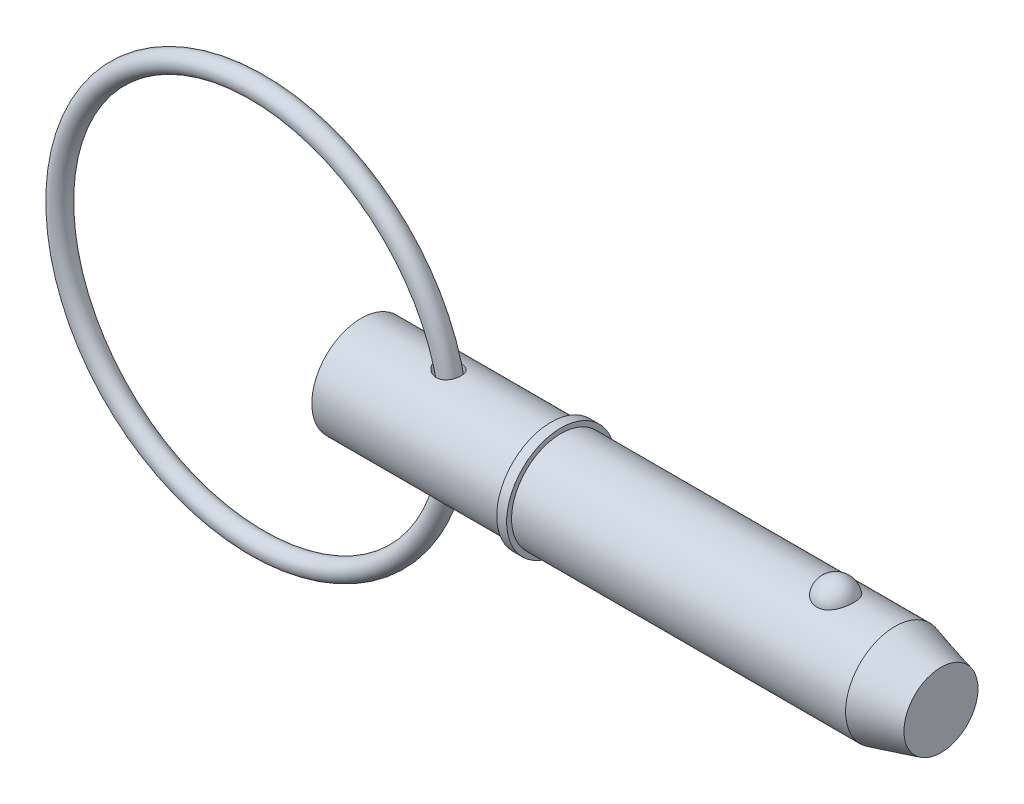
ISO-10303-21;
HEADER;
FILE_DESCRIPTION(('STEP AP214'),'2;1');
FILE_NAME('part.step','',(''),(''),'','','');
FILE_SCHEMA(('AUTOMOTIVE_DESIGN { 1 0 10303 214 1 1 1 1 }'));
ENDSEC;
DATA;
#1=APPLICATION_CONTEXT('core data for automotive mechanical design processes');
#2=APPLICATION_PROTOCOL_DEFINITION('international standard','automotive_design',2000,#1);
#3=PRODUCT_CONTEXT('',#1,'mechanical');
#4=PRODUCT('Part','Part','',(#3));
#5=PRODUCT_RELATED_PRODUCT_CATEGORY('part','',(#4));
#6=PRODUCT_DEFINITION_FORMATION('','',#4);
#7=PRODUCT_DEFINITION_CONTEXT('part definition',#1,'design');
#8=PRODUCT_DEFINITION('design','',#6,#7);
#9=PRODUCT_DEFINITION_SHAPE('','',#8);
#10=(LENGTH_UNIT() NAMED_UNIT(*) SI_UNIT(.MILLI.,.METRE.));
#11=(NAMED_UNIT(*) PLANE_ANGLE_UNIT() SI_UNIT($,.RADIAN.));
#12=(NAMED_UNIT(*) SI_UNIT($,.STERADIAN.) SOLID_ANGLE_UNIT());
#13=UNCERTAINTY_MEASURE_WITH_UNIT(LENGTH_MEASURE(1.E-05),#10,'distance_accuracy_value','');
#14=(GEOMETRIC_REPRESENTATION_CONTEXT(3) GLOBAL_UNCERTAINTY_ASSIGNED_CONTEXT((#13)) GLOBAL_UNIT_ASSIGNED_CONTEXT((#10,
#11,#12)) REPRESENTATION_CONTEXT('',''));
#15=CARTESIAN_POINT('',(0.,0.,0.));
#16=DIRECTION('',(0.,0.,1.));
#17=DIRECTION('',(1.,0.,0.));
#18=AXIS2_PLACEMENT_3D('',#15,#16,#17);
#19=CARTESIAN_POINT('',(-13.3798047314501,0.,0.));
#20=DIRECTION('',(0.,0.,1.));
#21=DIRECTION('',(1.,0.,0.));
#22=AXIS2_PLACEMENT_3D('',#19,#20,#21);
#23=TOROIDAL_SURFACE('',#22,25.4,1.27);
#24=CARTESIAN_POINT('',(13.2901952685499,0.,0.));
#25=VERTEX_POINT('',#24);
#26=VERTEX_LOOP('',#25);
#27=FACE_BOUND('',#26,.T.);
#28=ADVANCED_FACE('P0_F12',(#27),#23,.T.);
#29=CLOSED_SHELL('',(#28));
#30=MANIFOLD_SOLID_BREP('P0_B1',#29);
#31=CARTESIAN_POINT('',(0.,0.,0.));
#32=DIRECTION('',(1.,0.,0.));
#33=DIRECTION('',(0.,0.,-1.));
#34=AXIS2_PLACEMENT_3D('',#31,#32,#33);
#35=CYLINDRICAL_SURFACE('',#34,6.35);
#36=CARTESIAN_POINT('',(9.67500140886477,6.32698634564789,-0.540133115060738));
#37=CARTESIAN_POINT('',(9.70878953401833,6.3197498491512,-0.624879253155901));
#38=CARTESIAN_POINT('',(9.75028044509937,6.31105328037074,-0.706504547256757));
#39=CARTESIAN_POINT('',(9.84659255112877,6.29180070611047,-0.861319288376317));
#40=CARTESIAN_POINT('',(9.90144039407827,6.28124099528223,-0.934491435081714));
#41=CARTESIAN_POINT('',(10.021999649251,6.25949497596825,-1.0704877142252));
#42=CARTESIAN_POINT('',(10.0876589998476,6.2483118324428,-1.1333586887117));
#43=CARTESIAN_POINT('',(10.2280180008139,6.22641783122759,-1.24805262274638));
#44=CARTESIAN_POINT('',(10.3027159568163,6.21570688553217,-1.29987764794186));
#45=CARTESIAN_POINT('',(10.4650889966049,6.19509606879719,-1.39492899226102));
#46=CARTESIAN_POINT('',(10.5533142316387,6.1853135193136,-1.4372443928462));
#47=CARTESIAN_POINT('',(10.7357818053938,6.16871128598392,-1.50691441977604));
#48=CARTESIAN_POINT('',(10.8300253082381,6.16189217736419,-1.53426614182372));
#49=CARTESIAN_POINT('',(11.0227953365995,6.15211299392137,-1.57302798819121));
#50=CARTESIAN_POINT('',(11.1213511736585,6.14918579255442,-1.58430237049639));
#51=CARTESIAN_POINT('',(11.3189518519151,6.1478413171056,-1.58951619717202));
#52=CARTESIAN_POINT('',(11.417996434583,6.14942187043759,-1.58346399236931));
#53=CARTESIAN_POINT('',(11.6070859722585,6.15678569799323,-1.55457003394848));
#54=CARTESIAN_POINT('',(11.6973059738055,6.16229943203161,-1.53280404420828));
#55=CARTESIAN_POINT('',(11.8723373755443,6.176630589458,-1.4739892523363));
#56=CARTESIAN_POINT('',(11.9571502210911,6.185447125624,-1.43694455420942));
#57=CARTESIAN_POINT('',(12.1146737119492,6.20482821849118,-1.3507217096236));
#58=CARTESIAN_POINT('',(12.1877743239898,6.21528554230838,-1.30222952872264));
#59=CARTESIAN_POINT('',(12.324618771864,6.23705116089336,-1.19362916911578));
#60=CARTESIAN_POINT('',(12.3883628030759,6.24835943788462,-1.1335212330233));
#61=CARTESIAN_POINT('',(12.5046662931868,6.27053957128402,-1.00357204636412));
#62=CARTESIAN_POINT('',(12.5572571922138,6.28141258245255,-0.933759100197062));
#63=CARTESIAN_POINT('',(12.6502125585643,6.30157953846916,-0.786214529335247));
#64=CARTESIAN_POINT('',(12.6905764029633,6.31087340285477,-0.708482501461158));
#65=CARTESIAN_POINT('',(12.7585531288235,6.32699259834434,-0.546246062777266));
#66=CARTESIAN_POINT('',(12.7860022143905,6.33378599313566,-0.461669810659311));
#67=CARTESIAN_POINT('',(12.8267605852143,6.34401050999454,-0.288980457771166));
#68=CARTESIAN_POINT('',(12.8400695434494,6.34744155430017,-0.200867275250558));
#69=CARTESIAN_POINT('',(12.8522644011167,6.35058177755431,-0.0231943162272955));
#70=CARTESIAN_POINT('',(12.8510870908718,6.35027464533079,0.0663700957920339));
#71=CARTESIAN_POINT('',(12.8341831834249,6.34593169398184,0.244024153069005));
#72=CARTESIAN_POINT('',(12.8184563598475,6.341895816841,0.332113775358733));
#73=CARTESIAN_POINT('',(12.7728208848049,6.33052992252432,0.504322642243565));
#74=CARTESIAN_POINT('',(12.7429114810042,6.32319973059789,0.588441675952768));
#75=CARTESIAN_POINT('',(12.6696162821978,6.30604116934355,0.750316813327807));
#76=CARTESIAN_POINT('',(12.6262302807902,6.29621276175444,0.828072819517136));
#77=CARTESIAN_POINT('',(12.5270856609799,6.27515240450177,0.974918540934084));
#78=CARTESIAN_POINT('',(12.4713403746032,6.26392197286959,1.04401746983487));
#79=CARTESIAN_POINT('',(12.3488662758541,6.24131002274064,1.1716478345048));
#80=CARTESIAN_POINT('',(12.2821384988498,6.22992851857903,1.23018026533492));
#81=CARTESIAN_POINT('',(12.1401870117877,6.20841765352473,1.33449214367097));
#82=CARTESIAN_POINT('',(12.0650507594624,6.19827734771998,1.38038832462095));
#83=CARTESIAN_POINT('',(11.9079044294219,6.18026478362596,1.45892404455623));
#84=CARTESIAN_POINT('',(11.8258951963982,6.17239224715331,1.49156520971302));
#85=CARTESIAN_POINT('',(11.6581736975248,6.15982613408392,1.54263810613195));
#86=CARTESIAN_POINT('',(11.572502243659,6.15510409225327,1.56119728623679));
#87=CARTESIAN_POINT('',(11.3991899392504,6.14916283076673,1.58443707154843));
#88=CARTESIAN_POINT('',(11.3115488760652,6.14794399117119,1.58911617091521));
#89=CARTESIAN_POINT('',(11.1345547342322,6.14904466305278,1.58485137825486));
#90=CARTESIAN_POINT('',(11.0452104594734,6.15144894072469,1.5755811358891));
#91=CARTESIAN_POINT('',(10.8691479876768,6.15957601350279,1.54349959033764));
#92=CARTESIAN_POINT('',(10.782430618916,6.16529984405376,1.52068406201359));
#93=CARTESIAN_POINT('',(10.6082848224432,6.17983892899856,1.4605156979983));
#94=CARTESIAN_POINT('',(10.5211557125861,6.1888262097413,1.42233764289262));
#95=CARTESIAN_POINT('',(10.3542377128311,6.20874782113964,1.33268652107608));
#96=CARTESIAN_POINT('',(10.2744521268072,6.21968302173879,1.28120750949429));
#97=CARTESIAN_POINT('',(10.120854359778,6.24282707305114,1.16334748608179));
#98=CARTESIAN_POINT('',(10.0474902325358,6.25507146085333,1.09638652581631));
#99=CARTESIAN_POINT('',(9.91368693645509,6.27890019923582,0.950453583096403));
#100=CARTESIAN_POINT('',(9.85324511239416,6.29048468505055,0.87148407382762));
#101=CARTESIAN_POINT('',(9.75037543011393,6.31102161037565,0.707140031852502));
#102=CARTESIAN_POINT('',(9.70726585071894,6.32006820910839,0.622206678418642));
#103=CARTESIAN_POINT('',(9.63775895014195,6.33497125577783,0.445490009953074));
#104=CARTESIAN_POINT('',(9.61134627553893,6.34083063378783,0.35371307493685));
#105=CARTESIAN_POINT('',(9.57891955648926,6.34807071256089,0.177220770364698));
#106=CARTESIAN_POINT('',(9.5709352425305,6.3498832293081,0.0928817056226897));
#107=CARTESIAN_POINT('',(9.56994851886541,6.35010532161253,-0.0758268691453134));
#108=CARTESIAN_POINT('',(9.57692695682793,6.34851924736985,-0.160196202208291));
#109=CARTESIAN_POINT('',(9.59985709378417,6.34339435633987,-0.294043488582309));
#110=CARTESIAN_POINT('',(9.61128951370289,6.34084912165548,-0.34438537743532));
#111=CARTESIAN_POINT('',(9.63933183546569,6.33468615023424,-0.443526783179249));
#112=CARTESIAN_POINT('',(9.65594100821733,6.33106856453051,-0.492326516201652));
#113=CARTESIAN_POINT('',(9.67500140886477,6.32698634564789,-0.540133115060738));
#114=B_SPLINE_CURVE_WITH_KNOTS('',3,(#36,#37,#38,#39,#40,#41,#42,#43,#44,#45,#46,#47,#48,#49,
#50,#51,#52,#53,#54,#55,#56,#57,#58,#59,#60,#61,#62,#63,#64,#65,#66,#67,#68,#69,#70,#71,#72,#73,
#74,#75,#76,#77,#78,#79,#80,#81,#82,#83,#84,#85,#86,#87,#88,#89,#90,#91,#92,#93,#94,#95,#96,#97,
#98,#99,#100,#101,#102,#103,#104,#105,#106,#107,#108,#109,#110,#111,#112,#113),.UNSPECIFIED.,
.T.,.F.,(4,2,2,2,2,2,2,2,2,2,2,2,2,2,2,2,2,2,2,2,2,2,2,2,2,2,2,2,2,2,2,2,2,2,2,2,2,2,4),(0.,
0.274348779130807,0.54924945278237,0.822863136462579,1.09642560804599,1.3900770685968,
1.68378550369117,1.97995934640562,2.27599046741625,2.55347281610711,2.83088067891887,
3.09465189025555,3.35841759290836,3.62142956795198,3.88445494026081,4.1507318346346,
4.4170148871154,4.68446025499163,4.95190978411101,5.21937350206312,5.48684131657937,
5.75402200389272,6.02117751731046,6.28577524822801,6.55034050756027,6.81248178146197,
7.0746514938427,7.34305086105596,7.61153399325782,7.89692981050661,8.18245340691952,
8.48120635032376,8.77989784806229,9.06530254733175,9.35044442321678,9.60331609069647,
9.85586427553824,10.010650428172,10.1654147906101),.UNSPECIFIED.);
#115=CARTESIAN_POINT('',(9.67500140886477,6.32698634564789,-0.540133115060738));
#116=VERTEX_POINT('',#115);
#117=EDGE_CURVE('P1_E42',#116,#116,#114,.T.);
#118=ORIENTED_EDGE('',*,*,#117,.T.);
#119=EDGE_LOOP('',(#118));
#120=FACE_BOUND('',#119,.T.);
#121=CARTESIAN_POINT('',(0.,0.,0.));
#122=DIRECTION('',(1.,0.,0.));
#123=DIRECTION('',(0.,0.,-1.));
#124=AXIS2_PLACEMENT_3D('',#121,#122,#123);
#125=CIRCLE('',#124,6.35);
#126=CARTESIAN_POINT('',(0.,0.,-6.35));
#127=VERTEX_POINT('',#126);
#128=EDGE_CURVE('P1_E9',#127,#127,#125,.T.);
#129=ORIENTED_EDGE('',*,*,#128,.T.);
#130=EDGE_LOOP('',(#129));
#131=FACE_BOUND('',#130,.T.);
#132=CARTESIAN_POINT('',(24.43,0.,0.));
#133=DIRECTION('',(1.,0.,0.));
#134=DIRECTION('',(0.,0.,-1.));
#135=AXIS2_PLACEMENT_3D('',#132,#133,#134);
#136=CIRCLE('',#135,6.35);
#137=CARTESIAN_POINT('',(24.43,0.,-6.35));
#138=VERTEX_POINT('',#137);
#139=EDGE_CURVE('P1_E25',#138,#138,#136,.T.);
#140=ORIENTED_EDGE('',*,*,#139,.F.);
#141=EDGE_LOOP('',(#140));
#142=FACE_BOUND('',#141,.T.);
#143=CARTESIAN_POINT('',(9.67500140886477,-6.32698634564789,-0.540133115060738));
#144=CARTESIAN_POINT('',(9.64544894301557,-6.33331515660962,-0.46600258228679));
#145=CARTESIAN_POINT('',(9.62177180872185,-6.33852974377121,-0.389437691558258));
#146=CARTESIAN_POINT('',(9.58727043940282,-6.34619174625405,-0.233330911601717));
#147=CARTESIAN_POINT('',(9.57644043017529,-6.34864040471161,-0.153790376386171));
#148=CARTESIAN_POINT('',(9.56819517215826,-6.3505010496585,0.00612071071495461));
#149=CARTESIAN_POINT('',(9.57079639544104,-6.34990930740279,0.0864921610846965));
#150=CARTESIAN_POINT('',(9.58930797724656,-6.3457478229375,0.245607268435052));
#151=CARTESIAN_POINT('',(9.60522046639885,-6.34217760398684,0.324350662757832));
#152=CARTESIAN_POINT('',(9.64931570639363,-6.3324977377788,0.47727605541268));
#153=CARTESIAN_POINT('',(9.67737525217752,-6.32641361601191,0.551495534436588));
#154=CARTESIAN_POINT('',(9.74451510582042,-6.31231128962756,0.69455132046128));
#155=CARTESIAN_POINT('',(9.78359827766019,-6.30429258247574,0.763386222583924));
#156=CARTESIAN_POINT('',(9.87474700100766,-6.28638332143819,0.899414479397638));
#157=CARTESIAN_POINT('',(9.92757481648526,-6.27639669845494,0.966083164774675));
#158=CARTESIAN_POINT('',(10.042675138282,-6.25596164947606,1.09061181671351));
#159=CARTESIAN_POINT('',(10.1049521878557,-6.24551300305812,1.14846751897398));
#160=CARTESIAN_POINT('',(10.2445505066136,-6.22397505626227,1.26024641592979));
#161=CARTESIAN_POINT('',(10.3227711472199,-6.2129394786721,1.31305951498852));
#162=CARTESIAN_POINT('',(10.4867924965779,-6.19263757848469,1.40570084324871));
#163=CARTESIAN_POINT('',(10.5725962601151,-6.18337197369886,1.44552380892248));
#164=CARTESIAN_POINT('',(10.7543302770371,-6.16725983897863,1.51283687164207));
#165=CARTESIAN_POINT('',(10.8505554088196,-6.16056505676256,1.53957358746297));
#166=CARTESIAN_POINT('',(11.0463546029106,-6.15127671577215,1.57628137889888));
#167=CARTESIAN_POINT('',(11.1459276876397,-6.14868197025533,1.58625730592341));
#168=CARTESIAN_POINT('',(11.3414257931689,-6.14810798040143,1.58848000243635));
#169=CARTESIAN_POINT('',(11.4373417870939,-6.14995283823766,1.58140242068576));
#170=CARTESIAN_POINT('',(11.6262783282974,-6.1577972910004,1.55057566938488));
#171=CARTESIAN_POINT('',(11.719300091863,-6.16379511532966,1.52683360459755));
#172=CARTESIAN_POINT('',(11.8934223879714,-6.17873566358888,1.46514575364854));
#173=CARTESIAN_POINT('',(11.9749048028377,-6.18746207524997,1.42822144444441));
#174=CARTESIAN_POINT('',(12.1301362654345,-6.20693584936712,1.34105645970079));
#175=CARTESIAN_POINT('',(12.2038861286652,-6.21768299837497,1.29081719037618));
#176=CARTESIAN_POINT('',(12.3399792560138,-6.23970077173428,1.17972764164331));
#177=CARTESIAN_POINT('',(12.4025430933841,-6.25095401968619,1.11914355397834));
#178=CARTESIAN_POINT('',(12.5166805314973,-6.27296916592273,0.988307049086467));
#179=CARTESIAN_POINT('',(12.568253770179,-6.28373104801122,0.918054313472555));
#180=CARTESIAN_POINT('',(12.6596230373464,-6.3037060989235,0.769081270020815));
#181=CARTESIAN_POINT('',(12.6992956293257,-6.31290263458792,0.690283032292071));
#182=CARTESIAN_POINT('',(12.7652258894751,-6.32862394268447,0.527011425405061));
#183=CARTESIAN_POINT('',(12.7914829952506,-6.33514860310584,0.442537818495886));
#184=CARTESIAN_POINT('',(12.8301436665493,-6.34487485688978,0.269505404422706));
#185=CARTESIAN_POINT('',(12.8424230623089,-6.34804664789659,0.180917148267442));
#186=CARTESIAN_POINT('',(12.8524214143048,-6.35062347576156,0.00286829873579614));
#187=CARTESIAN_POINT('',(12.8501402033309,-6.35002846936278,-0.0865923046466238));
#188=CARTESIAN_POINT('',(12.8310619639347,-6.34513332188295,-0.263931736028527));
#189=CARTESIAN_POINT('',(12.8142517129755,-6.34082980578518,-0.35180904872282));
#190=CARTESIAN_POINT('',(12.7664911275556,-6.32897674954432,-0.523406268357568));
#191=CARTESIAN_POINT('',(12.7355404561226,-6.3214271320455,-0.607126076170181));
#192=CARTESIAN_POINT('',(12.6602298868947,-6.30390232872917,-0.768030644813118));
#193=CARTESIAN_POINT('',(12.6158695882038,-6.29392707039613,-0.845215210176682));
#194=CARTESIAN_POINT('',(12.5148171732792,-6.2726521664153,-0.990836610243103));
#195=CARTESIAN_POINT('',(12.4581254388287,-6.26135256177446,-1.05927371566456));
#196=CARTESIAN_POINT('',(12.33416419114,-6.2387572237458,-1.18510935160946));
#197=CARTESIAN_POINT('',(12.2669484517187,-6.22746174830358,-1.24256086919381));
#198=CARTESIAN_POINT('',(12.1235592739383,-6.20610255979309,-1.34519464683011));
#199=CARTESIAN_POINT('',(12.0473871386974,-6.19603866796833,-1.39037868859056));
#200=CARTESIAN_POINT('',(11.8892714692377,-6.17839642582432,-1.46678006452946));
#201=CARTESIAN_POINT('',(11.8074126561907,-6.17078838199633,-1.49816605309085));
#202=CARTESIAN_POINT('',(11.6394563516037,-6.15869606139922,-1.54712759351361));
#203=CARTESIAN_POINT('',(11.5533589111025,-6.15421174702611,-1.56470331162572));
#204=CARTESIAN_POINT('',(11.3789660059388,-6.14876652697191,-1.58596734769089));
#205=CARTESIAN_POINT('',(11.2906621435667,-6.1478222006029,-1.58959032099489));
#206=CARTESIAN_POINT('',(11.1146029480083,-6.149490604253,-1.58312110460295));
#207=CARTESIAN_POINT('',(11.0268477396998,-6.1521041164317,-1.57302589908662));
#208=CARTESIAN_POINT('',(10.8498668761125,-6.16071031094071,-1.53898332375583));
#209=CARTESIAN_POINT('',(10.7607726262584,-6.16685908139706,-1.51439468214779));
#210=CARTESIAN_POINT('',(10.5876521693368,-6.18189031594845,-1.45181305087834));
#211=CARTESIAN_POINT('',(10.5036282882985,-6.19077402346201,-1.41381396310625));
#212=CARTESIAN_POINT('',(10.3374228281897,-6.2109378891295,-1.32252480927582));
#213=CARTESIAN_POINT('',(10.255708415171,-6.2223355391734,-1.26840756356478));
#214=CARTESIAN_POINT('',(10.1025645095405,-6.24580740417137,-1.14725208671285));
#215=CARTESIAN_POINT('',(10.0311354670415,-6.25788164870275,-1.08021329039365));
#216=CARTESIAN_POINT('',(9.90472699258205,-6.2806176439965,-0.938710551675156));
#217=CARTESIAN_POINT('',(9.84904456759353,-6.29132066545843,-0.864883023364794));
#218=CARTESIAN_POINT('',(9.75129345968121,-6.31084098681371,-0.708496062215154));
#219=CARTESIAN_POINT('',(9.70921094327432,-6.31966019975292,-0.625945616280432));
#220=CARTESIAN_POINT('',(9.67500140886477,-6.32698634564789,-0.540133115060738));
#221=B_SPLINE_CURVE_WITH_KNOTS('',3,(#143,#144,#145,#146,#147,#148,#149,#150,#151,#152,#153,
#154,#155,#156,#157,#158,#159,#160,#161,#162,#163,#164,#165,#166,#167,#168,#169,#170,#171,#172,
#173,#174,#175,#176,#177,#178,#179,#180,#181,#182,#183,#184,#185,#186,#187,#188,#189,#190,#191,
#192,#193,#194,#195,#196,#197,#198,#199,#200,#201,#202,#203,#204,#205,#206,#207,#208,#209,#210,
#211,#212,#213,#214,#215,#216,#217,#218,#219,#220),.UNSPECIFIED.,.T.,.F.,(4,2,2,2,2,2,2,2,2,2,2,
2,2,2,2,2,2,2,2,2,2,2,2,2,2,2,2,2,2,2,2,2,2,2,2,2,2,2,4),(0.,0.239871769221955,
0.479635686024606,0.719693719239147,0.959790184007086,1.19750645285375,1.43528453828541,
1.69117930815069,1.94719750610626,2.23102979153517,2.51497694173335,2.81376497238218,
3.11246650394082,3.39952951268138,3.68647020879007,3.95479420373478,4.22308987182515,
4.48530700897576,4.74753278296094,5.01239119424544,5.27726070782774,5.54446524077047,
5.81167284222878,6.07912387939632,6.34658129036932,6.61404669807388,6.88150382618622,
7.1476364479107,7.41373039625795,7.67647472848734,7.93921589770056,8.20318607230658,
8.46721428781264,8.74390821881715,9.02072813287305,9.31537622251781,9.61003720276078,
9.88799314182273,10.1656654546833),.UNSPECIFIED.);
#222=CARTESIAN_POINT('',(9.67500140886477,-6.32698634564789,-0.540133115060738));
#223=VERTEX_POINT('',#222);
#224=EDGE_CURVE('P1_E17',#223,#223,#221,.T.);
#225=ORIENTED_EDGE('',*,*,#224,.T.);
#226=EDGE_LOOP('',(#225));
#227=FACE_BOUND('',#226,.T.);
#228=ADVANCED_FACE('P1_F13',(#120,#131,#142,#227),#35,.T.);
#229=CARTESIAN_POINT('',(0.,0.,0.));
#230=DIRECTION('',(1.,0.,0.));
#231=DIRECTION('',(0.,0.,-1.));
#232=AXIS2_PLACEMENT_3D('',#229,#230,#231);
#233=CYLINDRICAL_SURFACE('',#232,6.35);
#234=CARTESIAN_POINT('',(68.6753693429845,0.,0.));
#235=DIRECTION('',(1.,0.,0.));
#236=DIRECTION('',(0.,0.,-1.));
#237=AXIS2_PLACEMENT_3D('',#234,#235,#236);
#238=CIRCLE('',#237,6.35);
#239=CARTESIAN_POINT('',(68.6753693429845,0.,-6.35));
#240=VERTEX_POINT('',#239);
#241=EDGE_CURVE('P1_E99',#240,#240,#238,.T.);
#242=ORIENTED_EDGE('',*,*,#241,.F.);
#243=EDGE_LOOP('',(#242));
#244=FACE_BOUND('',#243,.T.);
#245=CARTESIAN_POINT('',(25.7,0.,0.));
#246=DIRECTION('',(1.,0.,0.));
#247=DIRECTION('',(0.,0.,-1.));
#248=AXIS2_PLACEMENT_3D('',#245,#246,#247);
#249=CIRCLE('',#248,6.35);
#250=CARTESIAN_POINT('',(25.7,0.,-6.35));
#251=VERTEX_POINT('',#250);
#252=EDGE_CURVE('P1_E96',#251,#251,#249,.T.);
#253=ORIENTED_EDGE('',*,*,#252,.T.);
#254=EDGE_LOOP('',(#253));
#255=FACE_BOUND('',#254,.T.);
#256=CARTESIAN_POINT('',(61.0500214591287,5.87502187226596,2.4096925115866));
#257=CARTESIAN_POINT('',(60.9250305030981,5.87501645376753,2.40969773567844));
#258=CARTESIAN_POINT('',(60.8000806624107,5.87916061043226,2.39967292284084));
#259=CARTESIAN_POINT('',(60.5539091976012,5.8952311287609,2.3599173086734));
#260=CARTESIAN_POINT('',(60.4326863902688,5.90715499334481,2.33019283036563));
#261=CARTESIAN_POINT('',(60.1975170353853,5.93739567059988,2.25201402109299));
#262=CARTESIAN_POINT('',(60.0835602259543,5.95570321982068,2.20358681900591));
#263=CARTESIAN_POINT('',(59.86557352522,5.99672067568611,2.08937987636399));
#264=CARTESIAN_POINT('',(59.7615457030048,6.01943149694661,2.02359652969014));
#265=CARTESIAN_POINT('',(59.5629437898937,6.06760647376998,1.87428969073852));
#266=CARTESIAN_POINT('',(59.4687268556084,6.09313095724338,1.79031110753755));
#267=CARTESIAN_POINT('',(59.2952557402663,6.14375873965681,1.60800178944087));
#268=CARTESIAN_POINT('',(59.2160043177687,6.16886196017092,1.50966841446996));
#269=CARTESIAN_POINT('',(59.0708457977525,6.21724600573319,1.29645884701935));
#270=CARTESIAN_POINT('',(59.0056885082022,6.24039621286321,1.18104158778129));
#271=CARTESIAN_POINT('',(58.8947035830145,6.28117277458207,0.940351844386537));
#272=CARTESIAN_POINT('',(58.8488776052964,6.29879865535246,0.815078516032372));
#273=CARTESIAN_POINT('',(58.7770234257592,6.32692073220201,0.556494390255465));
#274=CARTESIAN_POINT('',(58.751249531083,6.33732517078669,0.423102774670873));
#275=CARTESIAN_POINT('',(58.7209885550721,6.34957673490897,0.153542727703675));
#276=CARTESIAN_POINT('',(58.7165009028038,6.35142408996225,0.0173743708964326));
#277=CARTESIAN_POINT('',(58.7288655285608,6.34638925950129,-0.253036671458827));
#278=CARTESIAN_POINT('',(58.7455949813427,6.33955731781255,-0.387285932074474));
#279=CARTESIAN_POINT('',(58.799843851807,6.31794129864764,-0.650851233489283));
#280=CARTESIAN_POINT('',(58.8373636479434,6.30315707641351,-0.780167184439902));
#281=CARTESIAN_POINT('',(58.932500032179,6.26711642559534,-1.03041949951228));
#282=CARTESIAN_POINT('',(58.990143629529,6.24585130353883,-1.15134433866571));
#283=CARTESIAN_POINT('',(59.1243522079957,6.19905619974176,-1.38129800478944));
#284=CARTESIAN_POINT('',(59.2009187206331,6.17352587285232,-1.49032586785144));
#285=CARTESIAN_POINT('',(59.3717538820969,6.12080227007,-1.69393164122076));
#286=CARTESIAN_POINT('',(59.4661008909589,6.09360200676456,-1.78844209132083));
#287=CARTESIAN_POINT('',(59.6701196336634,6.04070434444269,-1.95970536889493));
#288=CARTESIAN_POINT('',(59.7797900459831,6.01500681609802,-2.03645972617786));
#289=CARTESIAN_POINT('',(60.0091876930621,5.96867714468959,-2.1684564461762));
#290=CARTESIAN_POINT('',(60.1286522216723,5.94794910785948,-2.2241206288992));
#291=CARTESIAN_POINT('',(60.3762188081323,5.91340580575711,-2.31440992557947));
#292=CARTESIAN_POINT('',(60.5043175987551,5.89958794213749,-2.34904294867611));
#293=CARTESIAN_POINT('',(60.758582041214,5.88111049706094,-2.39491590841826));
#294=CARTESIAN_POINT('',(60.8845207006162,5.87602512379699,-2.40724512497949));
#295=CARTESIAN_POINT('',(61.1367867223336,5.87428980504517,-2.41147867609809));
#296=CARTESIAN_POINT('',(61.263114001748,5.87763817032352,-2.40338710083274));
#297=CARTESIAN_POINT('',(61.5084170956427,5.89212921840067,-2.36762715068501));
#298=CARTESIAN_POINT('',(61.6274992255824,5.90302431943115,-2.34058030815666));
#299=CARTESIAN_POINT('',(61.8592447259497,5.93113752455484,-2.26839066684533));
#300=CARTESIAN_POINT('',(61.9719075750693,5.94835614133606,-2.2232464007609));
#301=CARTESIAN_POINT('',(62.1904009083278,5.98773016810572,-2.11493806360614));
#302=CARTESIAN_POINT('',(62.296028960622,6.00998499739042,-2.05140269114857));
#303=CARTESIAN_POINT('',(62.4953006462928,6.05690144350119,-1.90842705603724));
#304=CARTESIAN_POINT('',(62.5889415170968,6.08156361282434,-1.82898313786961));
#305=CARTESIAN_POINT('',(62.7666754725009,6.13211715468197,-1.65182429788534));
#306=CARTESIAN_POINT('',(62.8500559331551,6.15800825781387,-1.55339381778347));
#307=CARTESIAN_POINT('',(62.9997900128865,6.20712834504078,-1.34374214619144));
#308=CARTESIAN_POINT('',(63.0661405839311,6.23035685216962,-1.23251867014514));
#309=CARTESIAN_POINT('',(63.1823455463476,6.27251177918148,-0.996447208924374));
#310=CARTESIAN_POINT('',(63.2316072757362,6.29127762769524,-0.871278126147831));
#311=CARTESIAN_POINT('',(63.3096142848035,6.3215862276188,-0.613870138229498));
#312=CARTESIAN_POINT('',(63.3383593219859,6.33312889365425,-0.481631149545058));
#313=CARTESIAN_POINT('',(63.3747705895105,6.34782349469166,-0.213672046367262));
#314=CARTESIAN_POINT('',(63.3824134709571,6.35096613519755,-0.0779482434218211));
#315=CARTESIAN_POINT('',(63.3763951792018,6.34851322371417,0.192943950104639));
#316=CARTESIAN_POINT('',(63.3627343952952,6.3429178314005,0.328112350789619));
#317=CARTESIAN_POINT('',(63.3145036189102,6.32360512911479,0.593406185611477));
#318=CARTESIAN_POINT('',(63.2800313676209,6.30992579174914,0.723552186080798));
#319=CARTESIAN_POINT('',(63.1909539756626,6.27586325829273,0.975834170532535));
#320=CARTESIAN_POINT('',(63.1363476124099,6.25547965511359,1.09796966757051));
#321=CARTESIAN_POINT('',(63.0077587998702,6.20998183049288,1.33148921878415));
#322=CARTESIAN_POINT('',(62.9336742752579,6.18484288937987,1.44281227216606));
#323=CARTESIAN_POINT('',(62.7678204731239,6.13258735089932,1.65087683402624));
#324=CARTESIAN_POINT('',(62.6760515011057,6.10547078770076,1.74761859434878));
#325=CARTESIAN_POINT('',(62.4771839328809,6.05235879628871,1.92350926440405));
#326=CARTESIAN_POINT('',(62.370133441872,6.0263601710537,2.00271146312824));
#327=CARTESIAN_POINT('',(62.1431384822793,5.97843747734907,2.14154159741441));
#328=CARTESIAN_POINT('',(62.023191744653,5.95651412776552,2.20116608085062));
#329=CARTESIAN_POINT('',(61.7645236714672,5.91812106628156,2.30250570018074));
#330=CARTESIAN_POINT('',(61.6250698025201,5.90217533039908,2.34256795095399));
#331=CARTESIAN_POINT('',(61.3403974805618,5.88063128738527,2.39615214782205));
#332=CARTESIAN_POINT('',(61.1951817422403,5.8750281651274,2.40968644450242));
#333=CARTESIAN_POINT('',(61.0500214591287,5.87502187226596,2.4096925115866));
#334=B_SPLINE_CURVE_WITH_KNOTS('',3,(#256,#257,#258,#259,#260,#261,#262,#263,#264,#265,#266,
#267,#268,#269,#270,#271,#272,#273,#274,#275,#276,#277,#278,#279,#280,#281,#282,#283,#284,#285,
#286,#287,#288,#289,#290,#291,#292,#293,#294,#295,#296,#297,#298,#299,#300,#301,#302,#303,#304,
#305,#306,#307,#308,#309,#310,#311,#312,#313,#314,#315,#316,#317,#318,#319,#320,#321,#322,#323,
#324,#325,#326,#327,#328,#329,#330,#331,#332,#333),.UNSPECIFIED.,.T.,.F.,(4,2,2,2,2,2,2,2,2,2,2,
2,2,2,2,2,2,2,2,2,2,2,2,2,2,2,2,2,2,2,2,2,2,2,2,2,2,2,4),(0.,0.374440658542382,0.74876119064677,
1.12254078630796,1.49639810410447,1.88098871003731,2.26565013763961,2.6674110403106,
3.06920639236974,3.47601794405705,3.88281858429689,4.28727498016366,4.69173873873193,
5.09674745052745,5.50178895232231,5.90865911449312,6.31549420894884,6.71369855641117,
7.11175305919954,7.48978077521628,7.86773278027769,8.23383886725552,8.5999746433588,
8.97409044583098,9.34829231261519,9.74122667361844,10.1342313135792,10.5397522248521,
10.9452779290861,11.3512521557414,11.7572189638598,12.1612938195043,12.5653932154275,
12.9716540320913,13.3779078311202,13.7829098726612,14.1879832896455,14.6230486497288,
15.0579114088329),.UNSPECIFIED.);
#335=CARTESIAN_POINT('',(61.0500214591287,5.87502187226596,2.4096925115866));
#336=VERTEX_POINT('',#335);
#337=EDGE_CURVE('P1_E34',#336,#336,#334,.T.);
#338=ORIENTED_EDGE('',*,*,#337,.T.);
#339=EDGE_LOOP('',(#338));
#340=FACE_BOUND('',#339,.T.);
#341=ADVANCED_FACE('P1_F46',(#244,#255,#340),#233,.T.);
#342=CARTESIAN_POINT('',(0.,0.,0.));
#343=DIRECTION('',(-1.,0.,0.));
#344=DIRECTION('',(0.,0.,1.));
#345=AXIS2_PLACEMENT_3D('',#342,#343,#344);
#346=PLANE('',#345);
#347=ORIENTED_EDGE('',*,*,#128,.F.);
#348=EDGE_LOOP('',(#347));
#349=FACE_BOUND('',#348,.T.);
#350=ADVANCED_FACE('P1_F15',(#349),#346,.T.);
#351=CARTESIAN_POINT('',(24.43,6.35,0.));
#352=DIRECTION('',(-1.,0.,0.));
#353=DIRECTION('',(0.,0.,1.));
#354=AXIS2_PLACEMENT_3D('',#351,#352,#353);
#355=PLANE('',#354);
#356=ORIENTED_EDGE('',*,*,#139,.T.);
#357=EDGE_LOOP('',(#356));
#358=FACE_BOUND('',#357,.T.);
#359=CARTESIAN_POINT('',(24.43,0.,0.));
#360=DIRECTION('',(1.,0.,0.));
#361=DIRECTION('',(0.,0.,-1.));
#362=AXIS2_PLACEMENT_3D('',#359,#360,#361);
#363=CIRCLE('',#362,6.985);
#364=CARTESIAN_POINT('',(24.43,0.,-6.985));
#365=VERTEX_POINT('',#364);
#366=EDGE_CURVE('P1_E30',#365,#365,#363,.T.);
#367=ORIENTED_EDGE('',*,*,#366,.F.);
#368=EDGE_LOOP('',(#367));
#369=FACE_BOUND('',#368,.T.);
#370=ADVANCED_FACE('P1_F81',(#358,#369),#355,.T.);
#371=CARTESIAN_POINT('',(0.,0.,0.));
#372=DIRECTION('',(1.,0.,0.));
#373=DIRECTION('',(0.,0.,-1.));
#374=AXIS2_PLACEMENT_3D('',#371,#372,#373);
#375=CYLINDRICAL_SURFACE('',#374,6.985);
#376=ORIENTED_EDGE('',*,*,#366,.T.);
#377=EDGE_LOOP('',(#376));
#378=FACE_BOUND('',#377,.T.);
#379=CARTESIAN_POINT('',(25.7,0.,0.));
#380=DIRECTION('',(1.,0.,0.));
#381=DIRECTION('',(0.,0.,-1.));
#382=AXIS2_PLACEMENT_3D('',#379,#380,#381);
#383=CIRCLE('',#382,6.985);
#384=CARTESIAN_POINT('',(25.7,0.,-6.985));
#385=VERTEX_POINT('',#384);
#386=EDGE_CURVE('P1_E95',#385,#385,#383,.T.);
#387=ORIENTED_EDGE('',*,*,#386,.F.);
#388=EDGE_LOOP('',(#387));
#389=FACE_BOUND('',#388,.T.);
#390=ADVANCED_FACE('P1_F68',(#378,#389),#375,.T.);
#391=CARTESIAN_POINT('',(25.7,6.985,0.));
#392=DIRECTION('',(1.,0.,0.));
#393=DIRECTION('',(0.,0.,-1.));
#394=AXIS2_PLACEMENT_3D('',#391,#392,#393);
#395=PLANE('',#394);
#396=ORIENTED_EDGE('',*,*,#386,.T.);
#397=EDGE_LOOP('',(#396));
#398=FACE_BOUND('',#397,.T.);
#399=ORIENTED_EDGE('',*,*,#252,.F.);
#400=EDGE_LOOP('',(#399));
#401=FACE_BOUND('',#400,.T.);
#402=ADVANCED_FACE('P1_F62',(#398,#401),#395,.T.);
#403=CARTESIAN_POINT('',(74.6,0.,0.));
#404=DIRECTION('',(-1.,0.,0.));
#405=DIRECTION('',(0.,0.,1.));
#406=AXIS2_PLACEMENT_3D('',#403,#404,#405);
#407=CONICAL_SURFACE('',#406,4.76250000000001,0.26179938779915);
#408=ORIENTED_EDGE('',*,*,#241,.T.);
#409=EDGE_LOOP('',(#408));
#410=FACE_BOUND('',#409,.T.);
#411=CARTESIAN_POINT('',(74.6,0.,0.));
#412=DIRECTION('',(1.,0.,0.));
#413=DIRECTION('',(0.,0.,-1.));
#414=AXIS2_PLACEMENT_3D('',#411,#412,#413);
#415=CIRCLE('',#414,4.76250000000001);
#416=CARTESIAN_POINT('',(74.6,0.,-4.76250000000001));
#417=VERTEX_POINT('',#416);
#418=EDGE_CURVE('P1_E41',#417,#417,#415,.T.);
#419=ORIENTED_EDGE('',*,*,#418,.F.);
#420=EDGE_LOOP('',(#419));
#421=FACE_BOUND('',#420,.T.);
#422=ADVANCED_FACE('P1_F59',(#410,#421),#407,.T.);
#423=CARTESIAN_POINT('',(74.6,4.76250000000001,0.));
#424=DIRECTION('',(1.,0.,0.));
#425=DIRECTION('',(0.,0.,-1.));
#426=AXIS2_PLACEMENT_3D('',#423,#424,#425);
#427=PLANE('',#426);
#428=ORIENTED_EDGE('',*,*,#418,.T.);
#429=EDGE_LOOP('',(#428));
#430=FACE_BOUND('',#429,.T.);
#431=ADVANCED_FACE('P1_F55',(#430),#427,.T.);
#432=CARTESIAN_POINT('',(61.0500214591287,5.71499999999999,0.));
#433=DIRECTION('',(-1.,0.,0.));
#434=DIRECTION('',(0.,1.,0.));
#435=AXIS2_PLACEMENT_3D('',#432,#433,#434);
#436=SPHERICAL_SURFACE('',#435,2.41500000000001);
#437=ORIENTED_EDGE('',*,*,#337,.F.);
#438=EDGE_LOOP('',(#437));
#439=FACE_BOUND('',#438,.T.);
#440=ADVANCED_FACE('P1_F50',(#439),#436,.T.);
#441=CARTESIAN_POINT('',(-13.3798047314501,0.,0.));
#442=DIRECTION('',(0.,0.,1.));
#443=DIRECTION('',(1.,0.,0.));
#444=AXIS2_PLACEMENT_3D('',#441,#442,#443);
#445=TOROIDAL_SURFACE('',#444,25.4,1.5875);
#446=ORIENTED_EDGE('',*,*,#224,.F.);
#447=EDGE_LOOP('',(#446));
#448=FACE_BOUND('',#447,.T.);
#449=ORIENTED_EDGE('',*,*,#117,.F.);
#450=EDGE_LOOP('',(#449));
#451=FACE_BOUND('',#450,.T.);
#452=ADVANCED_FACE('P1_F54',(#448,#451),#445,.F.);
#453=CLOSED_SHELL('',(#228,#341,#350,#370,#390,#402,#422,#431,#440,#452));
#454=MANIFOLD_SOLID_BREP('P1_B1',#453);
#455=ADVANCED_BREP_SHAPE_REPRESENTATION('',(#18,#30,#454),#14);
#456=SHAPE_DEFINITION_REPRESENTATION(#9,#455);
ENDSEC;
END-ISO-10303-21;
